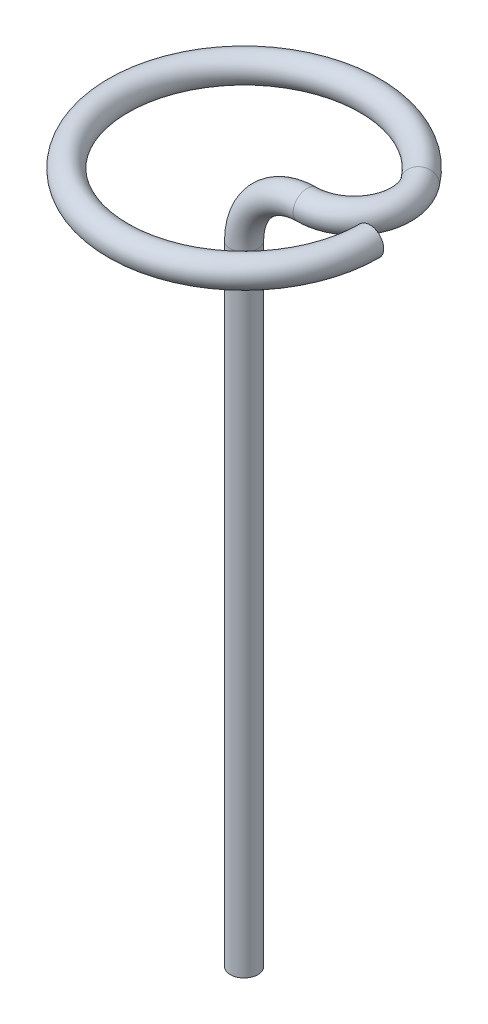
ISO-10303-21;
HEADER;
FILE_DESCRIPTION(('STEP AP214'),'2;1');
FILE_NAME('part.step','',(''),(''),'','','');
FILE_SCHEMA(('AUTOMOTIVE_DESIGN { 1 0 10303 214 1 1 1 1 }'));
ENDSEC;
DATA;
#1=APPLICATION_CONTEXT('core data for automotive mechanical design processes');
#2=APPLICATION_PROTOCOL_DEFINITION('international standard','automotive_design',2000,#1);
#3=PRODUCT_CONTEXT('',#1,'mechanical');
#4=PRODUCT('Part','Part','',(#3));
#5=PRODUCT_RELATED_PRODUCT_CATEGORY('part','',(#4));
#6=PRODUCT_DEFINITION_FORMATION('','',#4);
#7=PRODUCT_DEFINITION_CONTEXT('part definition',#1,'design');
#8=PRODUCT_DEFINITION('design','',#6,#7);
#9=PRODUCT_DEFINITION_SHAPE('','',#8);
#10=(LENGTH_UNIT() NAMED_UNIT(*) SI_UNIT(.MILLI.,.METRE.));
#11=(NAMED_UNIT(*) PLANE_ANGLE_UNIT() SI_UNIT($,.RADIAN.));
#12=(NAMED_UNIT(*) SI_UNIT($,.STERADIAN.) SOLID_ANGLE_UNIT());
#13=UNCERTAINTY_MEASURE_WITH_UNIT(LENGTH_MEASURE(1.E-05),#10,'distance_accuracy_value','');
#14=(GEOMETRIC_REPRESENTATION_CONTEXT(3) GLOBAL_UNCERTAINTY_ASSIGNED_CONTEXT((#13)) GLOBAL_UNIT_ASSIGNED_CONTEXT((#10,
#11,#12)) REPRESENTATION_CONTEXT('',''));
#15=CARTESIAN_POINT('',(0.,0.,0.));
#16=DIRECTION('',(0.,0.,1.));
#17=DIRECTION('',(1.,0.,0.));
#18=AXIS2_PLACEMENT_3D('',#15,#16,#17);
#19=CARTESIAN_POINT('',(0.,-1.27000000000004,0.));
#20=DIRECTION('',(0.,-1.,0.));
#21=DIRECTION('',(1.,0.,0.));
#22=AXIS2_PLACEMENT_3D('',#19,#20,#21);
#23=CYLINDRICAL_SURFACE('',#22,0.2794);
#24=CARTESIAN_POINT('',(0.,-1.27000000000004,0.));
#25=DIRECTION('',(0.,-1.,0.));
#26=DIRECTION('',(0.,0.,1.));
#27=AXIS2_PLACEMENT_3D('',#24,#25,#26);
#28=CIRCLE('',#27,0.2794);
#29=CARTESIAN_POINT('',(-0.2794,-1.27000000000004,0.));
#30=VERTEX_POINT('',#29);
#31=EDGE_CURVE('E36',#30,#30,#28,.T.);
#32=ORIENTED_EDGE('',*,*,#31,.T.);
#33=EDGE_LOOP('',(#32));
#34=FACE_BOUND('',#33,.T.);
#35=CARTESIAN_POINT('',(0.,-13.97,0.));
#36=DIRECTION('',(0.,-1.,0.));
#37=DIRECTION('',(0.,0.,1.));
#38=AXIS2_PLACEMENT_3D('',#35,#36,#37);
#39=CIRCLE('',#38,0.2794);
#40=CARTESIAN_POINT('',(0.,-13.97,0.2794));
#41=VERTEX_POINT('',#40);
#42=EDGE_CURVE('E10',#41,#41,#39,.T.);
#43=ORIENTED_EDGE('',*,*,#42,.F.);
#44=EDGE_LOOP('',(#43));
#45=FACE_BOUND('',#44,.T.);
#46=ADVANCED_FACE('F30',(#34,#45),#23,.T.);
#47=CARTESIAN_POINT('',(1.27,-1.27000000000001,0.));
#48=DIRECTION('',(0.,0.,1.));
#49=DIRECTION('',(1.,0.,0.));
#50=AXIS2_PLACEMENT_3D('',#47,#48,#49);
#51=TOROIDAL_SURFACE('',#50,1.27,0.2794);
#52=CARTESIAN_POINT('',(1.26999999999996,0.,0.));
#53=DIRECTION('',(-1.,0.,0.));
#54=DIRECTION('',(0.,0.,1.));
#55=AXIS2_PLACEMENT_3D('',#52,#53,#54);
#56=CIRCLE('',#55,0.2794);
#57=CARTESIAN_POINT('',(1.26999999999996,0.279399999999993,0.));
#58=VERTEX_POINT('',#57);
#59=EDGE_CURVE('E40',#58,#58,#56,.T.);
#60=CARTESIAN_POINT('',(1.27,-1.27000000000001,0.));
#61=DIRECTION('',(0.,0.,1.));
#62=DIRECTION('',(1.,0.,0.));
#63=AXIS2_PLACEMENT_3D('',#60,#61,#62);
#64=CIRCLE('',#63,1.5494);
#65=EDGE_CURVE('',#58,#30,#64,.T.);
#66=ORIENTED_EDGE('',*,*,#59,.T.);
#67=ORIENTED_EDGE('',*,*,#31,.F.);
#68=ORIENTED_EDGE('',*,*,#65,.T.);
#69=ORIENTED_EDGE('',*,*,#65,.F.);
#70=EDGE_LOOP('',(#66,#68,#67,#69));
#71=FACE_BOUND('',#70,.T.);
#72=ADVANCED_FACE('F68',(#71),#51,.T.);
#73=CARTESIAN_POINT('',(1.27,0.,-0.952500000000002));
#74=DIRECTION('',(0.,-1.,0.));
#75=DIRECTION('',(0.,0.,-1.));
#76=AXIS2_PLACEMENT_3D('',#73,#74,#75);
#77=TOROIDAL_SURFACE('',#76,0.9525,0.2794);
#78=CARTESIAN_POINT('',(2.03200000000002,0.,-1.52399999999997));
#79=DIRECTION('',(0.599999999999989,0.,0.800000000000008));
#80=DIRECTION('',(0.800000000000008,0.,-0.599999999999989));
#81=AXIS2_PLACEMENT_3D('',#78,#79,#80);
#82=CIRCLE('',#81,0.2794);
#83=CARTESIAN_POINT('',(2.25552000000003,0.,-1.69163999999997));
#84=VERTEX_POINT('',#83);
#85=EDGE_CURVE('E44',#84,#84,#82,.T.);
#86=ORIENTED_EDGE('',*,*,#85,.T.);
#87=EDGE_LOOP('',(#86));
#88=FACE_BOUND('',#87,.T.);
#89=ORIENTED_EDGE('',*,*,#59,.F.);
#90=EDGE_LOOP('',(#89));
#91=FACE_BOUND('',#90,.T.);
#92=ADVANCED_FACE('F63',(#88,#91),#77,.T.);
#93=CARTESIAN_POINT('',(0.,0.,0.));
#94=DIRECTION('',(0.,1.,0.));
#95=DIRECTION('',(0.,0.,1.));
#96=AXIS2_PLACEMENT_3D('',#93,#94,#95);
#97=TOROIDAL_SURFACE('',#96,2.54,0.2794);
#98=CARTESIAN_POINT('',(2.54,0.,0.));
#99=DIRECTION('',(0.,0.,1.));
#100=DIRECTION('',(1.,0.,0.));
#101=AXIS2_PLACEMENT_3D('',#98,#99,#100);
#102=CIRCLE('',#101,0.2794);
#103=CARTESIAN_POINT('',(2.8194,0.,0.));
#104=VERTEX_POINT('',#103);
#105=EDGE_CURVE('E49',#104,#104,#102,.T.);
#106=CARTESIAN_POINT('',(0.,0.,0.));
#107=DIRECTION('',(0.,1.,0.));
#108=DIRECTION('',(0.,0.,1.));
#109=AXIS2_PLACEMENT_3D('',#106,#107,#108);
#110=CIRCLE('',#109,2.8194);
#111=EDGE_CURVE('',#84,#104,#110,.T.);
#112=ORIENTED_EDGE('',*,*,#85,.F.);
#113=ORIENTED_EDGE('',*,*,#105,.T.);
#114=ORIENTED_EDGE('',*,*,#111,.T.);
#115=ORIENTED_EDGE('',*,*,#111,.F.);
#116=EDGE_LOOP('',(#112,#114,#113,#115));
#117=FACE_BOUND('',#116,.T.);
#118=ADVANCED_FACE('F53',(#117),#97,.T.);
#119=CARTESIAN_POINT('',(0.,-13.97,0.));
#120=DIRECTION('',(0.,-1.,0.));
#121=DIRECTION('',(0.,0.,1.));
#122=AXIS2_PLACEMENT_3D('',#119,#120,#121);
#123=PLANE('',#122);
#124=ORIENTED_EDGE('',*,*,#42,.T.);
#125=EDGE_LOOP('',(#124));
#126=FACE_BOUND('',#125,.T.);
#127=ADVANCED_FACE('F57',(#126),#123,.T.);
#128=CARTESIAN_POINT('',(2.54,0.,0.));
#129=DIRECTION('',(0.,0.,1.));
#130=DIRECTION('',(1.,0.,0.));
#131=AXIS2_PLACEMENT_3D('',#128,#129,#130);
#132=PLANE('',#131);
#133=ORIENTED_EDGE('',*,*,#105,.F.);
#134=EDGE_LOOP('',(#133));
#135=FACE_BOUND('',#134,.T.);
#136=ADVANCED_FACE('F55',(#135),#132,.F.);
#137=CLOSED_SHELL('',(#46,#72,#92,#118,#127,#136));
#138=MANIFOLD_SOLID_BREP('B2',#137);
#139=ADVANCED_BREP_SHAPE_REPRESENTATION('',(#18,#138),#14);
#140=SHAPE_DEFINITION_REPRESENTATION(#9,#139);
ENDSEC;
END-ISO-10303-21;
